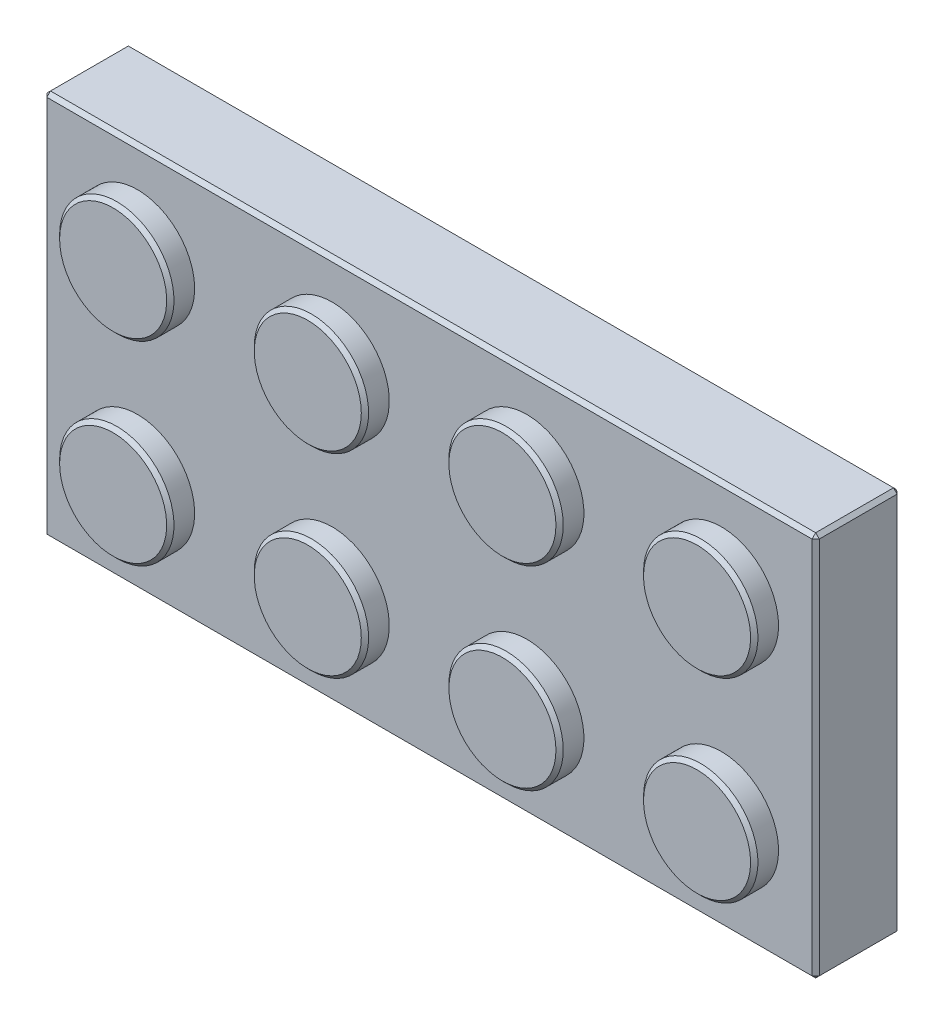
from build123d import *

# Parameters (mm, degrees)
SKIZZE1_W                       = 63.5
SKIZZE1_H                       = 31.7
AUFSATZ_LINEAR_AUSTRAGEN1_DEPTH = 7
SKIZZE2_R                       = 4.7
AUFSATZ_LINEAR_AUSTRAGEN2_DEPTH = 2
LINEARES_MUSTER3_COUNT          = 4
LINEARES_MUSTER3_PITCH          = 16
LINEARES_MUSTER3_COUNT_DIR2     = 2
LINEARES_MUSTER3_PITCH_DIR2     = 16
SCHNITT_LINEAR_AUSTRAGEN2_DEPTH = 2.5
AUFSATZ_LINEAR_START            = 2.5
AUFSATZ_LINEAR_AUSTRAGEN3_DEPTH = 2.5
LINEARES_MUSTER6_COUNT          = 3
LINEARES_MUSTER6_PITCH          = 16
FASE1_SIZE                      = 0.3
FASE2_SIZE                      = 0.3


with BuildPart() as part:
    # Skizze1 → Aufsatz-Linear austragen1 (new body)
    with BuildSketch(Plane.XY):
        Rectangle(SKIZZE1_W, SKIZZE1_H)
    extrude(amount=AUFSATZ_LINEAR_AUSTRAGEN1_DEPTH)

    # Skizze2 → Aufsatz-Linear austragen2 (add)
    with BuildSketch(Plane.XY.offset(7)):
        with Locations(Location((-24, 8, 0), (0, 0, 180))):
            Circle(SKIZZE2_R)
    aufsatz_linear_austragen2 = extrude(amount=AUFSATZ_LINEAR_AUSTRAGEN2_DEPTH)

    # Lineares Muster3: Aufsatz-Linear austragen2 4 × 2
    with Locations(*[(i * LINEARES_MUSTER3_PITCH, -j * LINEARES_MUSTER3_PITCH_DIR2, 0) for i in range(LINEARES_MUSTER3_COUNT) for j in range(LINEARES_MUSTER3_COUNT_DIR2) if (i, j) != (0, 0)]):
        add(aufsatz_linear_austragen2)

    # Skizze8 → Schnitt-Linear austragen2 (cut)
    with BuildSketch(Plane(origin=(0, 0, 0), x_dir=(-1, 0, 0), z_dir=(0, 0, -1))):
        with BuildLine():
            ThreePointArc((-25.047729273, -12.633008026), (-24.205299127, -12.745561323), (-23.356296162, -12.706181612))
            ThreePointArc((-23.356296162, -12.706181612), (-16, -15.1), (-8.643703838, -12.706181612))
            ThreePointArc((-8.643703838, -12.706181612), (-8, -12.75), (-7.356296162, -12.706181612))
            ThreePointArc((-7.356296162, -12.706181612), (0, -15.1), (7.356296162, -12.706181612))
            ThreePointArc((7.356296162, -12.706181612), (8, -12.75), (8.643703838, -12.706181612))
            ThreePointArc((8.643703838, -12.706181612), (16, -15.1), (23.356296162, -12.706181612))
            ThreePointArc((23.356296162, -12.706181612), (24.205299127, -12.745561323), (25.047729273, -12.633008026))
            ThreePointArc((25.047729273, -12.633008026), (30.094971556, -14.247345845), (28.605730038, -9.161787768))
            ThreePointArc((28.605730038, -9.161787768), (28.745542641, -8.205730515), (28.688993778, -7.241160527))
            ThreePointArc((28.688993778, -7.241160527), (31, 0), (28.688993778, 7.241160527))
            ThreePointArc((28.688993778, 7.241160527), (28.745542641, 8.205730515), (28.605730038, 9.161787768))
            ThreePointArc((28.605730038, 9.161787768), (30.094971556, 14.247345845), (25.047729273, 12.633008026))
            ThreePointArc((25.047729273, 12.633008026), (24.205299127, 12.745561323), (23.356296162, 12.706181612))
            ThreePointArc((23.356296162, 12.706181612), (16, 15.1), (8.643703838, 12.706181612))
            ThreePointArc((8.643703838, 12.706181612), (8, 12.75), (7.356296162, 12.706181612))
            ThreePointArc((7.356296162, 12.706181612), (0, 15.1), (-7.356296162, 12.706181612))
            ThreePointArc((-7.356296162, 12.706181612), (-8, 12.75), (-8.643703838, 12.706181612))
            ThreePointArc((-8.643703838, 12.706181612), (-16, 15.1), (-23.356296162, 12.706181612))
            ThreePointArc((-23.356296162, 12.706181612), (-24.205299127, 12.745561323), (-25.047729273, 12.633008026))
            ThreePointArc((-25.047729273, 12.633008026), (-30.094971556, 14.247345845), (-28.605730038, 9.161787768))
            ThreePointArc((-28.605730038, 9.161787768), (-28.745542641, 8.205730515), (-28.688993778, 7.241160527))
            ThreePointArc((-28.688993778, 7.241160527), (-31, 0), (-28.688993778, -7.241160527))
            ThreePointArc((-28.688993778, -7.241160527), (-28.745542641, -8.205730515), (-28.605730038, -9.161787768))
            ThreePointArc((-28.605730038, -9.161787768), (-30.094971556, -14.247345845), (-25.047729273, -12.633008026))
        make_face()
    extrude(amount=-SCHNITT_LINEAR_AUSTRAGEN2_DEPTH, mode=Mode.SUBTRACT)

    # Skizze9 → Aufsatz-Linear austragen3 (add)
    with BuildSketch(Plane(origin=(0, 0, 2.5), x_dir=(-1, 0, 0), z_dir=(0, 0, -1)).offset(AUFSATZ_LINEAR_START)):
        with BuildLine():
            Line((-11.990588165, -5.423625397), (-13.171572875, -4.242640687))
            ThreePointArc((-13.171572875, -4.242640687), (-16, -3.071067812), (-18.828427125, -4.242640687))
            Line((-18.828427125, -4.242640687), (-20.009411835, -5.423625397))
            ThreePointArc((-20.009411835, -5.423625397), (-20.641242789, -4.641242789), (-21.423625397, -4.009411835))
            Line((-21.423625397, -4.009411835), (-20.242640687, -2.828427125))
            ThreePointArc((-20.242640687, -2.828427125), (-19.071067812, 0), (-20.242640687, 2.828427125))
            Line((-20.242640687, 2.828427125), (-21.423625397, 4.009411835))
            ThreePointArc((-21.423625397, 4.009411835), (-20.641242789, 4.641242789), (-20.009411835, 5.423625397))
            Line((-20.009411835, 5.423625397), (-18.828427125, 4.242640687))
            ThreePointArc((-18.828427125, 4.242640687), (-16, 3.071067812), (-13.171572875, 4.242640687))
            Line((-13.171572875, 4.242640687), (-11.990588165, 5.423625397))
            ThreePointArc((-11.990588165, 5.423625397), (-11.358757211, 4.641242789), (-10.576374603, 4.009411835))
            Line((-10.576374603, 4.009411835), (-11.757359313, 2.828427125))
            ThreePointArc((-11.757359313, 2.828427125), (-12.928932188, 0), (-11.757359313, -2.828427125))
            Line((-11.757359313, -2.828427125), (-10.576374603, -4.009411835))
            ThreePointArc((-10.576374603, -4.009411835), (-11.358757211, -4.641242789), (-11.990588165, -5.423625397))
        make_face()
    aufsatz_linear_austragen3 = extrude(amount=-AUFSATZ_LINEAR_AUSTRAGEN3_DEPTH)

    # Lineares Muster6: Aufsatz-Linear austragen3 ×3
    with Locations(*[(-i * LINEARES_MUSTER6_PITCH, 0, 0) for i in range(1, LINEARES_MUSTER6_COUNT)]):
        add(aufsatz_linear_austragen3)

    # Fase1
    fase1_edges = [part.edges().sort_by_distance(p)[0] for p in [
        (31.75, 0, 7),
        (0, 15.85, 7),
        (-19.3, 8, 9),
        (-3.3, 8, 9),
        (12.7, 8, 9),
        (28.7, 8, 9),
        (-19.3, -8, 9),
        (-3.3, -8, 9),
        (12.7, -8, 9),
        (28.7, -8, 9),
        (-31.75, 0, 7),
        (0, -15.85, 7),
        (-31.75, 15.85, 3.5),
        (31.75, 15.85, 3.5),
        (31.75, -15.85, 3.5),
        (-31.75, -15.85, 3.5),
    ]]
    chamfer(fase1_edges, length=FASE1_SIZE)

    # Fase2
    fase2_edges = [part.edges().sort_by_distance(p)[0] for p in [
        (20.641242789, -4.641242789, 0),
        (16, -3.071067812, 0),
        (12.58108052, -4.833133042, 0),
        (11.358757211, -4.641242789, 0),
        (11.166866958, -3.41891948, 0),
        (11.358757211, 4.641242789, 0),
        (12.58108052, 4.833133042, 0),
        (16, 3.071067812, 0),
        (19.41891948, 4.833133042, 0),
        (20.641242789, 4.641242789, 0),
        (20.833133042, -3.41891948, 0),
        (19.41891948, -4.833133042, 0),
        (12.928932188, 0, 0),
        (11.166866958, 3.41891948, 0),
        (20.833133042, 3.41891948, 0),
        (19.071067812, 0, 0),
        (4.641242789, -4.641242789, 0),
        (0, -3.071067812, 0),
        (-3.41891948, -4.833133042, 0),
        (-4.641242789, -4.641242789, 0),
        (-4.833133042, -3.41891948, 0),
        (-4.641242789, 4.641242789, 0),
        (-3.41891948, 4.833133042, 0),
        (0, 3.071067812, 0),
        (3.41891948, 4.833133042, 0),
        (4.641242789, 4.641242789, 0),
        (4.833133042, -3.41891948, 0),
        (3.41891948, -4.833133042, 0),
        (-3.071067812, 0, 0),
        (-4.833133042, 3.41891948, 0),
        (4.833133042, 3.41891948, 0),
        (3.071067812, 0, 0),
        (-11.358757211, -4.641242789, 0),
        (-16, -3.071067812, 0),
        (-19.41891948, -4.833133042, 0),
        (-20.641242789, -4.641242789, 0),
        (-20.833133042, -3.41891948, 0),
        (-20.641242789, 4.641242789, 0),
        (-19.41891948, 4.833133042, 0),
        (-16, 3.071067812, 0),
        (-12.58108052, 4.833133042, 0),
        (-11.358757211, 4.641242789, 0),
        (-11.166866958, -3.41891948, 0),
        (-12.58108052, -4.833133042, 0),
        (-19.071067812, 0, 0),
        (-20.833133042, 3.41891948, 0),
        (-11.166866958, 3.41891948, 0),
        (-12.928932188, 0, 0),
        (31.75, 0, 0),
        (-31.75, 0, 0),
        (0, 15.85, 0),
        (0, -15.85, 0),
        (-31.6, 15.7, 0),
        (31.6, 15.7, 0),
        (-31.6, -15.7, 0),
        (31.6, -15.7, 0),
        (-24.205299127, -12.745561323, 0),
        (-16, -15.1, 0),
        (-8, -12.75, 0),
        (30.094971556, -14.247345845, 0),
        (30.094971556, 14.247345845, 0),
        (16, 15.1, 0),
        (0, 15.1, 0),
        (-8, 12.75, 0),
        (-24.205299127, 12.745561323, 0),
        (-28.745542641, 8.205730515, 0),
        (-31, 0, 0),
        (-28.745542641, -8.205730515, 0),
        (-30.094971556, -14.247345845, 0),
        (-30.094971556, 14.247345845, 0),
        (-16, 15.1, 0),
        (8, 12.75, 0),
        (24.205299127, 12.745561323, 0),
        (28.745542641, 8.205730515, 0),
        (31, 0, 0),
        (28.745542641, -8.205730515, 0),
        (24.205299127, -12.745561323, 0),
        (16, -15.1, 0),
        (8, -12.75, 0),
        (0, -15.1, 0),
    ]]
    chamfer(fase2_edges, length=FASE2_SIZE)


solid = part.part
